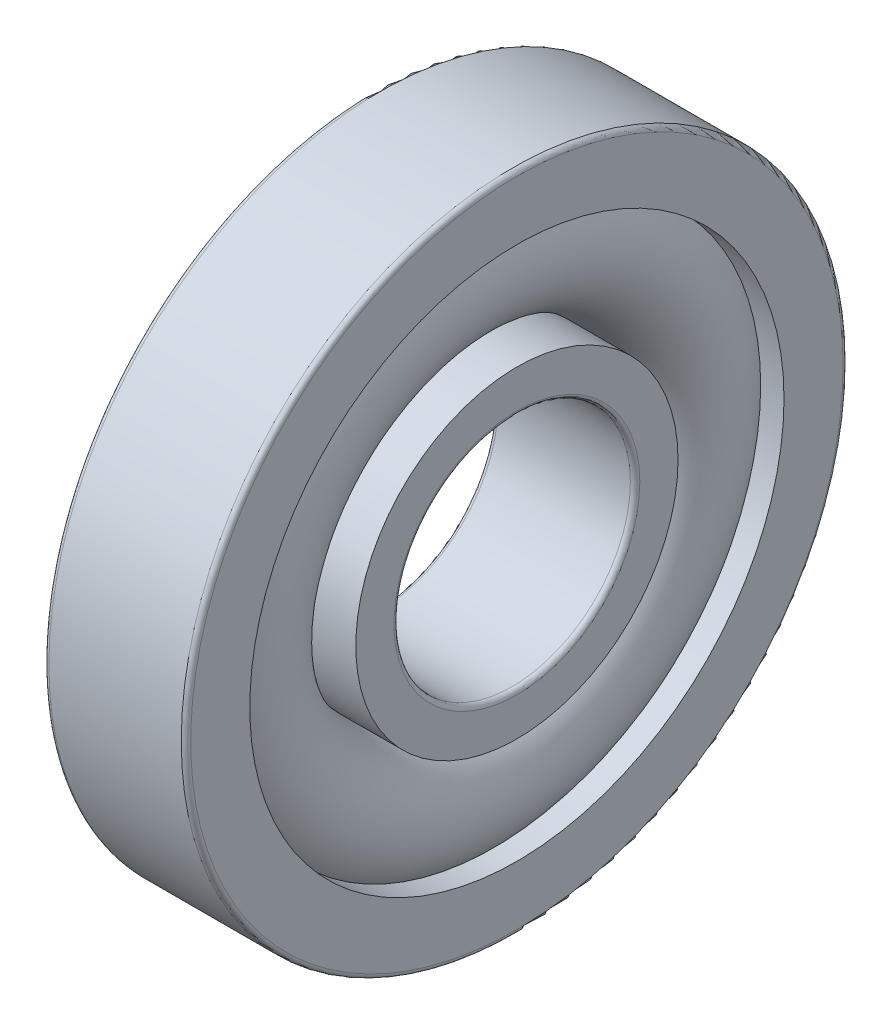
ISO-10303-21;
HEADER;
FILE_DESCRIPTION(('STEP AP214'),'2;1');
FILE_NAME('part.step','',(''),(''),'','','');
FILE_SCHEMA(('AUTOMOTIVE_DESIGN { 1 0 10303 214 1 1 1 1 }'));
ENDSEC;
DATA;
#1=APPLICATION_CONTEXT('core data for automotive mechanical design processes');
#2=APPLICATION_PROTOCOL_DEFINITION('international standard','automotive_design',2000,#1);
#3=PRODUCT_CONTEXT('',#1,'mechanical');
#4=PRODUCT('Part','Part','',(#3));
#5=PRODUCT_RELATED_PRODUCT_CATEGORY('part','',(#4));
#6=PRODUCT_DEFINITION_FORMATION('','',#4);
#7=PRODUCT_DEFINITION_CONTEXT('part definition',#1,'design');
#8=PRODUCT_DEFINITION('design','',#6,#7);
#9=PRODUCT_DEFINITION_SHAPE('','',#8);
#10=(LENGTH_UNIT() NAMED_UNIT(*) SI_UNIT(.MILLI.,.METRE.));
#11=(NAMED_UNIT(*) PLANE_ANGLE_UNIT() SI_UNIT($,.RADIAN.));
#12=(NAMED_UNIT(*) SI_UNIT($,.STERADIAN.) SOLID_ANGLE_UNIT());
#13=UNCERTAINTY_MEASURE_WITH_UNIT(LENGTH_MEASURE(1.E-05),#10,'distance_accuracy_value','');
#14=(GEOMETRIC_REPRESENTATION_CONTEXT(3) GLOBAL_UNCERTAINTY_ASSIGNED_CONTEXT((#13)) GLOBAL_UNIT_ASSIGNED_CONTEXT((#10,
#11,#12)) REPRESENTATION_CONTEXT('',''));
#15=CARTESIAN_POINT('',(0.,0.,0.));
#16=DIRECTION('',(0.,0.,1.));
#17=DIRECTION('',(1.,0.,0.));
#18=AXIS2_PLACEMENT_3D('',#15,#16,#17);
#19=CARTESIAN_POINT('',(0.,0.,0.));
#20=DIRECTION('',(-1.,0.,0.));
#21=DIRECTION('',(0.,0.,1.));
#22=AXIS2_PLACEMENT_3D('',#19,#20,#21);
#23=TOROIDAL_SURFACE('',#22,14.25,4.05);
#24=CARTESIAN_POINT('',(3.01869176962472,0.,0.));
#25=DIRECTION('',(-1.,0.,0.));
#26=DIRECTION('',(0.,0.,1.));
#27=AXIS2_PLACEMENT_3D('',#24,#25,#26);
#28=CIRCLE('',#27,16.95);
#29=CARTESIAN_POINT('',(3.01869176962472,0.,16.95));
#30=VERTEX_POINT('',#29);
#31=EDGE_CURVE('E33',#30,#30,#28,.F.);
#32=ORIENTED_EDGE('',*,*,#31,.T.);
#33=EDGE_LOOP('',(#32));
#34=FACE_BOUND('',#33,.T.);
#35=CARTESIAN_POINT('',(0.449305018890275,0.,0.));
#36=DIRECTION('',(-1.,0.,0.));
#37=DIRECTION('',(0.,0.,1.));
#38=AXIS2_PLACEMENT_3D('',#35,#36,#37);
#39=CIRCLE('',#38,10.225);
#40=CARTESIAN_POINT('',(0.449305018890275,0.,10.225));
#41=VERTEX_POINT('',#40);
#42=EDGE_CURVE('E10',#41,#41,#39,.T.);
#43=ORIENTED_EDGE('',*,*,#42,.T.);
#44=EDGE_LOOP('',(#43));
#45=FACE_BOUND('',#44,.T.);
#46=ADVANCED_FACE('F29',(#34,#45),#23,.T.);
#47=CARTESIAN_POINT('',(-20.6375,0.,0.));
#48=DIRECTION('',(1.,0.,0.));
#49=DIRECTION('',(0.,0.,-1.));
#50=AXIS2_PLACEMENT_3D('',#47,#48,#49);
#51=CYLINDRICAL_SURFACE('',#50,10.225);
#52=CARTESIAN_POINT('',(4.5,0.,0.));
#53=DIRECTION('',(1.,0.,0.));
#54=DIRECTION('',(0.,0.,-1.));
#55=AXIS2_PLACEMENT_3D('',#52,#53,#54);
#56=CIRCLE('',#55,10.225);
#57=CARTESIAN_POINT('',(4.5,0.,-10.225));
#58=VERTEX_POINT('',#57);
#59=EDGE_CURVE('E42',#58,#58,#56,.T.);
#60=ORIENTED_EDGE('',*,*,#59,.F.);
#61=EDGE_LOOP('',(#60));
#62=FACE_BOUND('',#61,.T.);
#63=ORIENTED_EDGE('',*,*,#42,.F.);
#64=EDGE_LOOP('',(#63));
#65=FACE_BOUND('',#64,.T.);
#66=ADVANCED_FACE('F81',(#62,#65),#51,.T.);
#67=CARTESIAN_POINT('',(-20.6375,0.,0.));
#68=DIRECTION('',(1.,0.,0.));
#69=DIRECTION('',(0.,0.,-1.));
#70=AXIS2_PLACEMENT_3D('',#67,#68,#69);
#71=CYLINDRICAL_SURFACE('',#70,11.55);
#72=CARTESIAN_POINT('',(-4.50000000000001,0.,0.));
#73=DIRECTION('',(1.,0.,0.));
#74=DIRECTION('',(0.,0.,-1.));
#75=AXIS2_PLACEMENT_3D('',#72,#73,#74);
#76=CIRCLE('',#75,11.55);
#77=CARTESIAN_POINT('',(-4.50000000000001,0.,-11.55));
#78=VERTEX_POINT('',#77);
#79=EDGE_CURVE('E51',#78,#78,#76,.T.);
#80=ORIENTED_EDGE('',*,*,#79,.T.);
#81=EDGE_LOOP('',(#80));
#82=FACE_BOUND('',#81,.T.);
#83=CARTESIAN_POINT('',(-3.01869176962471,0.,0.));
#84=DIRECTION('',(1.,0.,0.));
#85=DIRECTION('',(0.,0.,-1.));
#86=AXIS2_PLACEMENT_3D('',#83,#84,#85);
#87=CIRCLE('',#86,11.55);
#88=CARTESIAN_POINT('',(-3.01869176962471,0.,-11.55));
#89=VERTEX_POINT('',#88);
#90=EDGE_CURVE('E37',#89,#89,#87,.T.);
#91=ORIENTED_EDGE('',*,*,#90,.F.);
#92=EDGE_LOOP('',(#91));
#93=FACE_BOUND('',#92,.T.);
#94=ADVANCED_FACE('F84',(#82,#93),#71,.T.);
#95=CARTESIAN_POINT('',(4.50000000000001,7.8,0.));
#96=DIRECTION('',(1.,0.,0.));
#97=DIRECTION('',(0.,0.,-1.));
#98=AXIS2_PLACEMENT_3D('',#95,#96,#97);
#99=PLANE('',#98);
#100=ORIENTED_EDGE('',*,*,#59,.T.);
#101=EDGE_LOOP('',(#100));
#102=FACE_BOUND('',#101,.T.);
#103=CARTESIAN_POINT('',(4.50000000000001,0.,0.));
#104=DIRECTION('',(1.,0.,0.));
#105=DIRECTION('',(0.,0.,-1.));
#106=AXIS2_PLACEMENT_3D('',#103,#104,#105);
#107=CIRCLE('',#106,7.8);
#108=CARTESIAN_POINT('',(4.50000000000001,0.,-7.8));
#109=VERTEX_POINT('',#108);
#110=EDGE_CURVE('E73',#109,#109,#107,.T.);
#111=ORIENTED_EDGE('',*,*,#110,.F.);
#112=EDGE_LOOP('',(#111));
#113=FACE_BOUND('',#112,.T.);
#114=ADVANCED_FACE('F78',(#102,#113),#99,.T.);
#115=CARTESIAN_POINT('',(4.20000000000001,0.,0.));
#116=DIRECTION('',(1.,0.,0.));
#117=DIRECTION('',(0.,0.,-1.));
#118=AXIS2_PLACEMENT_3D('',#115,#116,#117);
#119=TOROIDAL_SURFACE('',#118,7.8,0.300000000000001);
#120=ORIENTED_EDGE('',*,*,#110,.T.);
#121=EDGE_LOOP('',(#120));
#122=FACE_BOUND('',#121,.T.);
#123=CARTESIAN_POINT('',(4.20000000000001,0.,0.));
#124=DIRECTION('',(1.,0.,0.));
#125=DIRECTION('',(0.,0.,-1.));
#126=AXIS2_PLACEMENT_3D('',#123,#124,#125);
#127=CIRCLE('',#126,7.5);
#128=CARTESIAN_POINT('',(4.20000000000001,0.,-7.5));
#129=VERTEX_POINT('',#128);
#130=EDGE_CURVE('E70',#129,#129,#127,.T.);
#131=ORIENTED_EDGE('',*,*,#130,.F.);
#132=EDGE_LOOP('',(#131));
#133=FACE_BOUND('',#132,.T.);
#134=ADVANCED_FACE('F95',(#122,#133),#119,.T.);
#135=CARTESIAN_POINT('',(-20.6375,0.,0.));
#136=DIRECTION('',(1.,0.,0.));
#137=DIRECTION('',(0.,0.,-1.));
#138=AXIS2_PLACEMENT_3D('',#135,#136,#137);
#139=CYLINDRICAL_SURFACE('',#138,7.5);
#140=ORIENTED_EDGE('',*,*,#130,.T.);
#141=EDGE_LOOP('',(#140));
#142=FACE_BOUND('',#141,.T.);
#143=CARTESIAN_POINT('',(-4.20000000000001,0.,0.));
#144=DIRECTION('',(1.,0.,0.));
#145=DIRECTION('',(0.,0.,-1.));
#146=AXIS2_PLACEMENT_3D('',#143,#144,#145);
#147=CIRCLE('',#146,7.5);
#148=CARTESIAN_POINT('',(-4.20000000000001,0.,-7.5));
#149=VERTEX_POINT('',#148);
#150=EDGE_CURVE('E67',#149,#149,#147,.T.);
#151=ORIENTED_EDGE('',*,*,#150,.F.);
#152=EDGE_LOOP('',(#151));
#153=FACE_BOUND('',#152,.T.);
#154=ADVANCED_FACE('F98',(#142,#153),#139,.F.);
#155=CARTESIAN_POINT('',(-4.20000000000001,0.,0.));
#156=DIRECTION('',(1.,0.,0.));
#157=DIRECTION('',(0.,0.,-1.));
#158=AXIS2_PLACEMENT_3D('',#155,#156,#157);
#159=TOROIDAL_SURFACE('',#158,7.8,0.300000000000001);
#160=ORIENTED_EDGE('',*,*,#150,.T.);
#161=EDGE_LOOP('',(#160));
#162=FACE_BOUND('',#161,.T.);
#163=CARTESIAN_POINT('',(-4.50000000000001,0.,0.));
#164=DIRECTION('',(1.,0.,0.));
#165=DIRECTION('',(0.,0.,-1.));
#166=AXIS2_PLACEMENT_3D('',#163,#164,#165);
#167=CIRCLE('',#166,7.8);
#168=CARTESIAN_POINT('',(-4.50000000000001,0.,-7.8));
#169=VERTEX_POINT('',#168);
#170=EDGE_CURVE('E64',#169,#169,#167,.T.);
#171=ORIENTED_EDGE('',*,*,#170,.F.);
#172=EDGE_LOOP('',(#171));
#173=FACE_BOUND('',#172,.T.);
#174=ADVANCED_FACE('F102',(#162,#173),#159,.T.);
#175=CARTESIAN_POINT('',(-4.50000000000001,11.55,0.));
#176=DIRECTION('',(-1.,0.,0.));
#177=DIRECTION('',(0.,0.,1.));
#178=AXIS2_PLACEMENT_3D('',#175,#176,#177);
#179=PLANE('',#178);
#180=ORIENTED_EDGE('',*,*,#170,.T.);
#181=EDGE_LOOP('',(#180));
#182=FACE_BOUND('',#181,.T.);
#183=ORIENTED_EDGE('',*,*,#79,.F.);
#184=EDGE_LOOP('',(#183));
#185=FACE_BOUND('',#184,.T.);
#186=ADVANCED_FACE('F106',(#182,#185),#179,.T.);
#187=CARTESIAN_POINT('',(-0.449305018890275,0.,0.));
#188=DIRECTION('',(1.,0.,0.));
#189=DIRECTION('',(0.,0.,-1.));
#190=AXIS2_PLACEMENT_3D('',#187,#188,#189);
#191=CIRCLE('',#190,18.275);
#192=CARTESIAN_POINT('',(-0.449305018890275,0.,-18.275));
#193=VERTEX_POINT('',#192);
#194=EDGE_CURVE('E45',#193,#193,#191,.F.);
#195=ORIENTED_EDGE('',*,*,#194,.T.);
#196=EDGE_LOOP('',(#195));
#197=FACE_BOUND('',#196,.T.);
#198=ORIENTED_EDGE('',*,*,#90,.T.);
#199=EDGE_LOOP('',(#198));
#200=FACE_BOUND('',#199,.T.);
#201=ADVANCED_FACE('F31',(#197,#200),#23,.T.);
#202=CARTESIAN_POINT('',(-20.6375,0.,0.));
#203=DIRECTION('',(1.,0.,0.));
#204=DIRECTION('',(0.,0.,-1.));
#205=AXIS2_PLACEMENT_3D('',#202,#203,#204);
#206=CYLINDRICAL_SURFACE('',#205,16.95);
#207=CARTESIAN_POINT('',(4.50000000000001,0.,0.));
#208=DIRECTION('',(1.,0.,0.));
#209=DIRECTION('',(0.,0.,-1.));
#210=AXIS2_PLACEMENT_3D('',#207,#208,#209);
#211=CIRCLE('',#210,16.95);
#212=CARTESIAN_POINT('',(4.50000000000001,0.,-16.95));
#213=VERTEX_POINT('',#212);
#214=EDGE_CURVE('E147',#213,#213,#211,.T.);
#215=ORIENTED_EDGE('',*,*,#214,.T.);
#216=EDGE_LOOP('',(#215));
#217=FACE_BOUND('',#216,.T.);
#218=ORIENTED_EDGE('',*,*,#31,.F.);
#219=EDGE_LOOP('',(#218));
#220=FACE_BOUND('',#219,.T.);
#221=ADVANCED_FACE('F128',(#217,#220),#206,.F.);
#222=CARTESIAN_POINT('',(-20.6375,0.,0.));
#223=DIRECTION('',(1.,0.,0.));
#224=DIRECTION('',(0.,0.,-1.));
#225=AXIS2_PLACEMENT_3D('',#222,#223,#224);
#226=CYLINDRICAL_SURFACE('',#225,18.275);
#227=CARTESIAN_POINT('',(-4.50000000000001,0.,0.));
#228=DIRECTION('',(1.,0.,0.));
#229=DIRECTION('',(0.,0.,-1.));
#230=AXIS2_PLACEMENT_3D('',#227,#228,#229);
#231=CIRCLE('',#230,18.275);
#232=CARTESIAN_POINT('',(-4.50000000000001,0.,-18.275));
#233=VERTEX_POINT('',#232);
#234=EDGE_CURVE('E142',#233,#233,#231,.T.);
#235=ORIENTED_EDGE('',*,*,#234,.F.);
#236=EDGE_LOOP('',(#235));
#237=FACE_BOUND('',#236,.T.);
#238=ORIENTED_EDGE('',*,*,#194,.F.);
#239=EDGE_LOOP('',(#238));
#240=FACE_BOUND('',#239,.T.);
#241=ADVANCED_FACE('F115',(#237,#240),#226,.F.);
#242=CARTESIAN_POINT('',(-4.20000000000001,0.,0.));
#243=DIRECTION('',(1.,0.,0.));
#244=DIRECTION('',(0.,0.,-1.));
#245=AXIS2_PLACEMENT_3D('',#242,#243,#244);
#246=TOROIDAL_SURFACE('',#245,20.7,0.300000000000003);
#247=CARTESIAN_POINT('',(-4.50000000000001,0.,0.));
#248=DIRECTION('',(1.,0.,0.));
#249=DIRECTION('',(0.,0.,-1.));
#250=AXIS2_PLACEMENT_3D('',#247,#248,#249);
#251=CIRCLE('',#250,20.7);
#252=CARTESIAN_POINT('',(-4.50000000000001,0.,-20.7));
#253=VERTEX_POINT('',#252);
#254=EDGE_CURVE('E145',#253,#253,#251,.T.);
#255=ORIENTED_EDGE('',*,*,#254,.T.);
#256=EDGE_LOOP('',(#255));
#257=FACE_BOUND('',#256,.T.);
#258=CARTESIAN_POINT('',(-4.20000000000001,0.,0.));
#259=DIRECTION('',(1.,0.,0.));
#260=DIRECTION('',(0.,0.,-1.));
#261=AXIS2_PLACEMENT_3D('',#258,#259,#260);
#262=CIRCLE('',#261,21.);
#263=CARTESIAN_POINT('',(-4.20000000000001,0.,-21.));
#264=VERTEX_POINT('',#263);
#265=EDGE_CURVE('E47',#264,#264,#262,.T.);
#266=ORIENTED_EDGE('',*,*,#265,.F.);
#267=EDGE_LOOP('',(#266));
#268=FACE_BOUND('',#267,.T.);
#269=ADVANCED_FACE('F111',(#257,#268),#246,.T.);
#270=CARTESIAN_POINT('',(-20.6375,0.,0.));
#271=DIRECTION('',(1.,0.,0.));
#272=DIRECTION('',(0.,0.,-1.));
#273=AXIS2_PLACEMENT_3D('',#270,#271,#272);
#274=CYLINDRICAL_SURFACE('',#273,21.);
#275=ORIENTED_EDGE('',*,*,#265,.T.);
#276=EDGE_LOOP('',(#275));
#277=FACE_BOUND('',#276,.T.);
#278=CARTESIAN_POINT('',(4.20000000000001,0.,0.));
#279=DIRECTION('',(1.,0.,0.));
#280=DIRECTION('',(0.,0.,-1.));
#281=AXIS2_PLACEMENT_3D('',#278,#279,#280);
#282=CIRCLE('',#281,21.);
#283=CARTESIAN_POINT('',(4.20000000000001,0.,-21.));
#284=VERTEX_POINT('',#283);
#285=EDGE_CURVE('E53',#284,#284,#282,.T.);
#286=ORIENTED_EDGE('',*,*,#285,.F.);
#287=EDGE_LOOP('',(#286));
#288=FACE_BOUND('',#287,.T.);
#289=ADVANCED_FACE('F114',(#277,#288),#274,.T.);
#290=CARTESIAN_POINT('',(4.20000000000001,0.,0.));
#291=DIRECTION('',(1.,0.,0.));
#292=DIRECTION('',(0.,0.,-1.));
#293=AXIS2_PLACEMENT_3D('',#290,#291,#292);
#294=TOROIDAL_SURFACE('',#293,20.7,0.300000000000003);
#295=ORIENTED_EDGE('',*,*,#285,.T.);
#296=EDGE_LOOP('',(#295));
#297=FACE_BOUND('',#296,.T.);
#298=CARTESIAN_POINT('',(4.50000000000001,0.,0.));
#299=DIRECTION('',(1.,0.,0.));
#300=DIRECTION('',(0.,0.,-1.));
#301=AXIS2_PLACEMENT_3D('',#298,#299,#300);
#302=CIRCLE('',#301,20.7);
#303=CARTESIAN_POINT('',(4.50000000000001,0.,-20.7));
#304=VERTEX_POINT('',#303);
#305=EDGE_CURVE('E58',#304,#304,#302,.T.);
#306=ORIENTED_EDGE('',*,*,#305,.F.);
#307=EDGE_LOOP('',(#306));
#308=FACE_BOUND('',#307,.T.);
#309=ADVANCED_FACE('F119',(#297,#308),#294,.T.);
#310=CARTESIAN_POINT('',(4.50000000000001,20.7,0.));
#311=DIRECTION('',(1.,0.,0.));
#312=DIRECTION('',(0.,0.,-1.));
#313=AXIS2_PLACEMENT_3D('',#310,#311,#312);
#314=PLANE('',#313);
#315=ORIENTED_EDGE('',*,*,#305,.T.);
#316=EDGE_LOOP('',(#315));
#317=FACE_BOUND('',#316,.T.);
#318=ORIENTED_EDGE('',*,*,#214,.F.);
#319=EDGE_LOOP('',(#318));
#320=FACE_BOUND('',#319,.T.);
#321=ADVANCED_FACE('F122',(#317,#320),#314,.T.);
#322=CARTESIAN_POINT('',(-4.50000000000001,18.275,0.));
#323=DIRECTION('',(-1.,0.,0.));
#324=DIRECTION('',(0.,0.,1.));
#325=AXIS2_PLACEMENT_3D('',#322,#323,#324);
#326=PLANE('',#325);
#327=ORIENTED_EDGE('',*,*,#234,.T.);
#328=EDGE_LOOP('',(#327));
#329=FACE_BOUND('',#328,.T.);
#330=ORIENTED_EDGE('',*,*,#254,.F.);
#331=EDGE_LOOP('',(#330));
#332=FACE_BOUND('',#331,.T.);
#333=ADVANCED_FACE('F126',(#329,#332),#326,.T.);
#334=CLOSED_SHELL('',(#46,#66,#94,#114,#134,#154,#174,#186,#201,#221,#241,#269,#289,#309,#321,#333));
#335=MANIFOLD_SOLID_BREP('B2',#334);
#336=ADVANCED_BREP_SHAPE_REPRESENTATION('',(#18,#335),#14);
#337=SHAPE_DEFINITION_REPRESENTATION(#9,#336);
ENDSEC;
END-ISO-10303-21;
